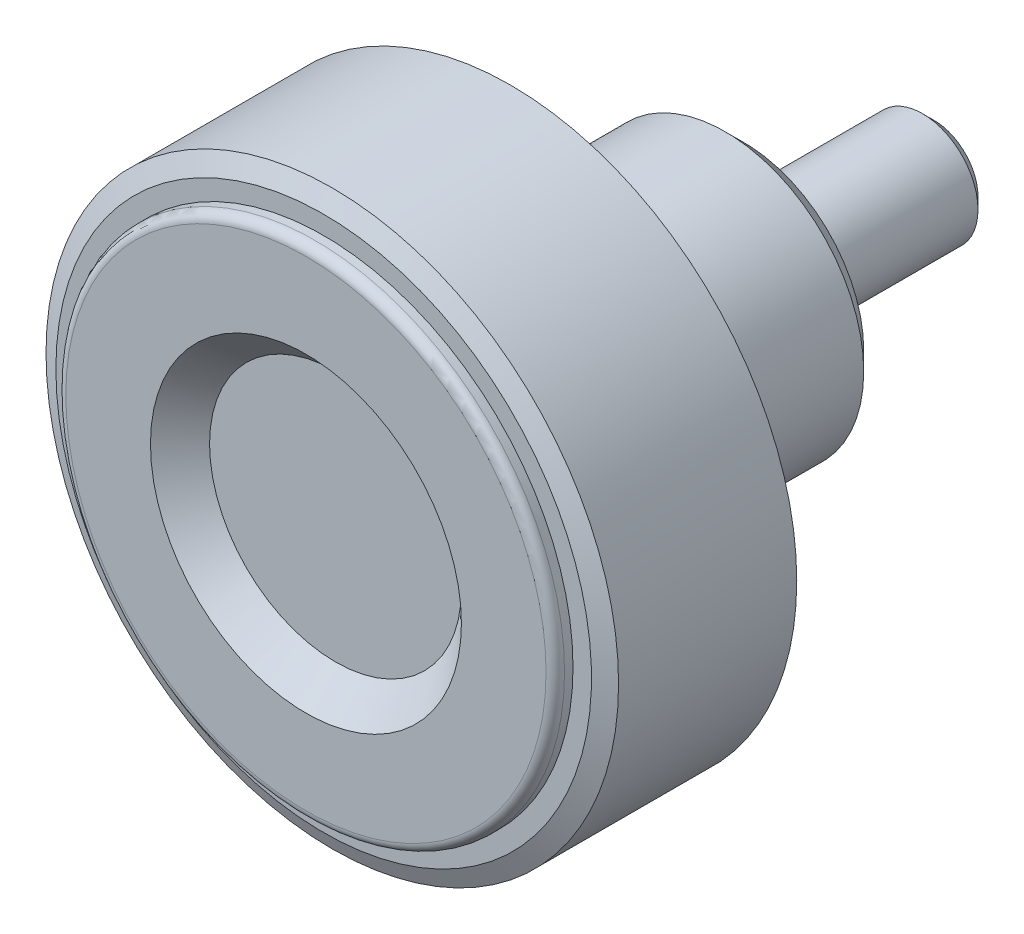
ISO-10303-21;
HEADER;
FILE_DESCRIPTION(('STEP AP214'),'2;1');
FILE_NAME('part.step','',(''),(''),'','','');
FILE_SCHEMA(('AUTOMOTIVE_DESIGN { 1 0 10303 214 1 1 1 1 }'));
ENDSEC;
DATA;
#1=APPLICATION_CONTEXT('core data for automotive mechanical design processes');
#2=APPLICATION_PROTOCOL_DEFINITION('international standard','automotive_design',2000,#1);
#3=PRODUCT_CONTEXT('',#1,'mechanical');
#4=PRODUCT('Part','Part','',(#3));
#5=PRODUCT_RELATED_PRODUCT_CATEGORY('part','',(#4));
#6=PRODUCT_DEFINITION_FORMATION('','',#4);
#7=PRODUCT_DEFINITION_CONTEXT('part definition',#1,'design');
#8=PRODUCT_DEFINITION('design','',#6,#7);
#9=PRODUCT_DEFINITION_SHAPE('','',#8);
#10=(LENGTH_UNIT() NAMED_UNIT(*) SI_UNIT(.MILLI.,.METRE.));
#11=(NAMED_UNIT(*) PLANE_ANGLE_UNIT() SI_UNIT($,.RADIAN.));
#12=(NAMED_UNIT(*) SI_UNIT($,.STERADIAN.) SOLID_ANGLE_UNIT());
#13=UNCERTAINTY_MEASURE_WITH_UNIT(LENGTH_MEASURE(1.E-05),#10,'distance_accuracy_value','');
#14=(GEOMETRIC_REPRESENTATION_CONTEXT(3) GLOBAL_UNCERTAINTY_ASSIGNED_CONTEXT((#13)) GLOBAL_UNIT_ASSIGNED_CONTEXT((#10,
#11,#12)) REPRESENTATION_CONTEXT('',''));
#15=CARTESIAN_POINT('',(0.,0.,0.));
#16=DIRECTION('',(0.,0.,1.));
#17=DIRECTION('',(1.,0.,0.));
#18=AXIS2_PLACEMENT_3D('',#15,#16,#17);
#19=CARTESIAN_POINT('',(0.,0.,0.));
#20=DIRECTION('',(0.,0.,-1.));
#21=DIRECTION('',(-1.,0.,0.));
#22=AXIS2_PLACEMENT_3D('',#19,#20,#21);
#23=CYLINDRICAL_SURFACE('',#22,15.5);
#24=CARTESIAN_POINT('',(0.,0.,22.573692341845));
#25=DIRECTION('',(0.,0.,-1.));
#26=DIRECTION('',(-1.,0.,0.));
#27=AXIS2_PLACEMENT_3D('',#24,#25,#26);
#28=CIRCLE('',#27,15.5);
#29=CARTESIAN_POINT('',(-15.5,0.,22.573692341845));
#30=VERTEX_POINT('',#29);
#31=EDGE_CURVE('E164',#30,#30,#28,.T.);
#32=ORIENTED_EDGE('',*,*,#31,.T.);
#33=EDGE_LOOP('',(#32));
#34=FACE_BOUND('',#33,.T.);
#35=CARTESIAN_POINT('',(0.,0.,12.926307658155));
#36=DIRECTION('',(0.,0.,1.));
#37=DIRECTION('',(0.,1.,0.));
#38=AXIS2_PLACEMENT_3D('',#35,#36,#37);
#39=CIRCLE('',#38,15.5);
#40=CARTESIAN_POINT('',(0.,15.5,12.926307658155));
#41=VERTEX_POINT('',#40);
#42=EDGE_CURVE('E160',#41,#41,#39,.F.);
#43=ORIENTED_EDGE('',*,*,#42,.F.);
#44=EDGE_LOOP('',(#43));
#45=FACE_BOUND('',#44,.T.);
#46=ADVANCED_FACE('F14',(#34,#45),#23,.T.);
#47=CARTESIAN_POINT('',(0.,0.,12.926307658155));
#48=DIRECTION('',(0.,0.,1.));
#49=DIRECTION('',(1.,0.,0.));
#50=AXIS2_PLACEMENT_3D('',#47,#48,#49);
#51=CONICAL_SURFACE('',#50,15.5,1.13446401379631);
#52=ORIENTED_EDGE('',*,*,#42,.T.);
#53=EDGE_LOOP('',(#52));
#54=FACE_BOUND('',#53,.T.);
#55=CARTESIAN_POINT('',(0.,0.,12.46));
#56=DIRECTION('',(0.,0.,1.));
#57=DIRECTION('',(1.,0.,0.));
#58=AXIS2_PLACEMENT_3D('',#55,#56,#57);
#59=CIRCLE('',#58,14.5);
#60=CARTESIAN_POINT('',(14.5,0.,12.46));
#61=VERTEX_POINT('',#60);
#62=EDGE_CURVE('E157',#61,#61,#59,.F.);
#63=ORIENTED_EDGE('',*,*,#62,.F.);
#64=EDGE_LOOP('',(#63));
#65=FACE_BOUND('',#64,.T.);
#66=ADVANCED_FACE('F457',(#54,#65),#51,.T.);
#67=CARTESIAN_POINT('',(0.,14.,12.46));
#68=DIRECTION('',(0.,0.,-1.));
#69=DIRECTION('',(-1.,0.,0.));
#70=AXIS2_PLACEMENT_3D('',#67,#68,#69);
#71=PLANE('',#70);
#72=ORIENTED_EDGE('',*,*,#62,.T.);
#73=EDGE_LOOP('',(#72));
#74=FACE_BOUND('',#73,.T.);
#75=CARTESIAN_POINT('',(0.,0.,12.46));
#76=DIRECTION('',(0.,0.,1.));
#77=DIRECTION('',(1.,0.,0.));
#78=AXIS2_PLACEMENT_3D('',#75,#76,#77);
#79=CIRCLE('',#78,13.5);
#80=CARTESIAN_POINT('',(13.5,0.,12.46));
#81=VERTEX_POINT('',#80);
#82=EDGE_CURVE('E154',#81,#81,#79,.F.);
#83=ORIENTED_EDGE('',*,*,#82,.F.);
#84=EDGE_LOOP('',(#83));
#85=FACE_BOUND('',#84,.T.);
#86=ADVANCED_FACE('F453',(#74,#85),#71,.T.);
#87=CARTESIAN_POINT('',(0.,1.19325,-10.));
#88=DIRECTION('',(0.,0.,-1.));
#89=DIRECTION('',(-1.,0.,0.));
#90=AXIS2_PLACEMENT_3D('',#87,#88,#89);
#91=PLANE('',#90);
#92=CARTESIAN_POINT('',(0.,0.,-9.99999999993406));
#93=DIRECTION('',(0.,0.,1.));
#94=DIRECTION('',(1.,0.,0.));
#95=AXIS2_PLACEMENT_3D('',#92,#93,#94);
#96=CIRCLE('',#95,2.38650000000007);
#97=CARTESIAN_POINT('',(2.38650000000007,0.,-9.99999999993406));
#98=VERTEX_POINT('',#97);
#99=EDGE_CURVE('E150',#98,#98,#96,.T.);
#100=ORIENTED_EDGE('',*,*,#99,.F.);
#101=EDGE_LOOP('',(#100));
#102=FACE_BOUND('',#101,.T.);
#103=ADVANCED_FACE('F449',(#102),#91,.T.);
#104=CARTESIAN_POINT('',(0.,0.,12.23));
#105=DIRECTION('',(0.,0.,1.));
#106=DIRECTION('',(1.,0.,0.));
#107=AXIS2_PLACEMENT_3D('',#104,#105,#106);
#108=CYLINDRICAL_SURFACE('',#107,13.5);
#109=ORIENTED_EDGE('',*,*,#82,.T.);
#110=EDGE_LOOP('',(#109));
#111=FACE_BOUND('',#110,.T.);
#112=CARTESIAN_POINT('',(0.,0.,12.));
#113=DIRECTION('',(0.,0.,-1.));
#114=DIRECTION('',(-1.,0.,0.));
#115=AXIS2_PLACEMENT_3D('',#112,#113,#114);
#116=CIRCLE('',#115,13.5);
#117=CARTESIAN_POINT('',(-13.5,0.,12.));
#118=VERTEX_POINT('',#117);
#119=EDGE_CURVE('E153',#118,#118,#116,.T.);
#120=ORIENTED_EDGE('',*,*,#119,.F.);
#121=EDGE_LOOP('',(#120));
#122=FACE_BOUND('',#121,.T.);
#123=ADVANCED_FACE('F416',(#111,#122),#108,.T.);
#124=CARTESIAN_POINT('',(0.,0.,-9.38649999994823));
#125=DIRECTION('',(0.,0.,1.));
#126=DIRECTION('',(1.,0.,0.));
#127=AXIS2_PLACEMENT_3D('',#124,#125,#126);
#128=CONICAL_SURFACE('',#127,2.99999999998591,0.785398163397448);
#129=ORIENTED_EDGE('',*,*,#99,.T.);
#130=EDGE_LOOP('',(#129));
#131=FACE_BOUND('',#130,.T.);
#132=CARTESIAN_POINT('',(0.,0.,-9.3865));
#133=DIRECTION('',(0.,0.,1.));
#134=DIRECTION('',(1.,0.,0.));
#135=AXIS2_PLACEMENT_3D('',#132,#133,#134);
#136=CIRCLE('',#135,3.);
#137=CARTESIAN_POINT('',(3.,0.,-9.3865));
#138=VERTEX_POINT('',#137);
#139=EDGE_CURVE('E343',#138,#138,#136,.T.);
#140=ORIENTED_EDGE('',*,*,#139,.F.);
#141=EDGE_LOOP('',(#140));
#142=FACE_BOUND('',#141,.T.);
#143=ADVANCED_FACE('F410',(#131,#142),#128,.T.);
#144=CARTESIAN_POINT('',(0.,0.,12.));
#145=DIRECTION('',(0.,0.,-1.));
#146=DIRECTION('',(-1.,0.,0.));
#147=AXIS2_PLACEMENT_3D('',#144,#145,#146);
#148=TOROIDAL_SURFACE('',#147,13.,0.5);
#149=ORIENTED_EDGE('',*,*,#119,.T.);
#150=EDGE_LOOP('',(#149));
#151=FACE_BOUND('',#150,.T.);
#152=CARTESIAN_POINT('',(0.,0.,11.5));
#153=DIRECTION('',(0.,0.,1.));
#154=DIRECTION('',(1.,0.,0.));
#155=AXIS2_PLACEMENT_3D('',#152,#153,#154);
#156=CIRCLE('',#155,13.);
#157=CARTESIAN_POINT('',(0.,13.,11.5));
#158=VERTEX_POINT('',#157);
#159=CARTESIAN_POINT('',(13.,0.,11.5));
#160=VERTEX_POINT('',#159);
#161=EDGE_CURVE('E306',#158,#160,#156,.F.);
#162=ORIENTED_EDGE('',*,*,#161,.F.);
#163=CARTESIAN_POINT('',(0.,0.,11.5));
#164=DIRECTION('',(0.,0.,1.));
#165=DIRECTION('',(0.,1.,0.));
#166=AXIS2_PLACEMENT_3D('',#163,#164,#165);
#167=CIRCLE('',#166,13.);
#168=CARTESIAN_POINT('',(-13.,0.,11.5));
#169=VERTEX_POINT('',#168);
#170=EDGE_CURVE('E149',#169,#158,#167,.F.);
#171=ORIENTED_EDGE('',*,*,#170,.F.);
#172=CARTESIAN_POINT('',(0.,0.,11.5));
#173=DIRECTION('',(0.,0.,1.));
#174=DIRECTION('',(-1.,0.,0.));
#175=AXIS2_PLACEMENT_3D('',#172,#173,#174);
#176=CIRCLE('',#175,13.);
#177=EDGE_CURVE('E340',#160,#169,#176,.F.);
#178=ORIENTED_EDGE('',*,*,#177,.F.);
#179=EDGE_LOOP('',(#162,#171,#178));
#180=FACE_BOUND('',#179,.T.);
#181=ADVANCED_FACE('F405',(#151,#180),#148,.T.);
#182=CARTESIAN_POINT('',(0.,0.,-4.19325));
#183=DIRECTION('',(0.,0.,1.));
#184=DIRECTION('',(1.,0.,0.));
#185=AXIS2_PLACEMENT_3D('',#182,#183,#184);
#186=CYLINDRICAL_SURFACE('',#185,3.);
#187=ORIENTED_EDGE('',*,*,#139,.T.);
#188=EDGE_LOOP('',(#187));
#189=FACE_BOUND('',#188,.T.);
#190=CARTESIAN_POINT('',(0.,0.,0.));
#191=DIRECTION('',(0.,0.,1.));
#192=DIRECTION('',(1.,0.,0.));
#193=AXIS2_PLACEMENT_3D('',#190,#191,#192);
#194=CIRCLE('',#193,3.);
#195=CARTESIAN_POINT('',(3.,0.,0.));
#196=VERTEX_POINT('',#195);
#197=EDGE_CURVE('E146',#196,#196,#194,.T.);
#198=ORIENTED_EDGE('',*,*,#197,.F.);
#199=EDGE_LOOP('',(#198));
#200=FACE_BOUND('',#199,.T.);
#201=ADVANCED_FACE('F323',(#189,#200),#186,.T.);
#202=CARTESIAN_POINT('',(0.,12.4615384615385,11.5));
#203=DIRECTION('',(0.,0.,-1.));
#204=DIRECTION('',(-1.,0.,0.));
#205=AXIS2_PLACEMENT_3D('',#202,#203,#204);
#206=PLANE('',#205);
#207=ORIENTED_EDGE('',*,*,#177,.T.);
#208=ORIENTED_EDGE('',*,*,#170,.T.);
#209=ORIENTED_EDGE('',*,*,#161,.T.);
#210=EDGE_LOOP('',(#207,#208,#209));
#211=FACE_BOUND('',#210,.T.);
#212=CARTESIAN_POINT('',(0.,0.,11.5));
#213=DIRECTION('',(0.,0.,1.));
#214=DIRECTION('',(1.,0.,0.));
#215=AXIS2_PLACEMENT_3D('',#212,#213,#214);
#216=CIRCLE('',#215,11.9230769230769);
#217=CARTESIAN_POINT('',(11.9230769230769,0.,11.5));
#218=VERTEX_POINT('',#217);
#219=EDGE_CURVE('E143',#218,#218,#216,.T.);
#220=ORIENTED_EDGE('',*,*,#219,.T.);
#221=EDGE_LOOP('',(#220));
#222=FACE_BOUND('',#221,.T.);
#223=ADVANCED_FACE('F312',(#211,#222),#206,.T.);
#224=CARTESIAN_POINT('',(0.,2.,0.));
#225=DIRECTION('',(0.,0.,-1.));
#226=DIRECTION('',(-1.,0.,0.));
#227=AXIS2_PLACEMENT_3D('',#224,#225,#226);
#228=PLANE('',#227);
#229=CARTESIAN_POINT('',(0.,0.,0.));
#230=DIRECTION('',(0.,0.,1.));
#231=DIRECTION('',(1.,0.,0.));
#232=AXIS2_PLACEMENT_3D('',#229,#230,#231);
#233=CIRCLE('',#232,4.);
#234=CARTESIAN_POINT('',(4.,0.,0.));
#235=VERTEX_POINT('',#234);
#236=EDGE_CURVE('E140',#235,#235,#233,.T.);
#237=ORIENTED_EDGE('',*,*,#236,.F.);
#238=EDGE_LOOP('',(#237));
#239=FACE_BOUND('',#238,.T.);
#240=ORIENTED_EDGE('',*,*,#197,.T.);
#241=EDGE_LOOP('',(#240));
#242=FACE_BOUND('',#241,.T.);
#243=ADVANCED_FACE('F322',(#239,#242),#228,.T.);
#244=CARTESIAN_POINT('',(0.,0.,15.25));
#245=DIRECTION('',(0.,0.,1.));
#246=DIRECTION('',(1.,0.,0.));
#247=AXIS2_PLACEMENT_3D('',#244,#245,#246);
#248=CYLINDRICAL_SURFACE('',#247,11.9230769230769);
#249=CARTESIAN_POINT('',(0.,0.,19.));
#250=DIRECTION('',(0.,0.,-1.));
#251=DIRECTION('',(-1.,0.,0.));
#252=AXIS2_PLACEMENT_3D('',#249,#250,#251);
#253=CIRCLE('',#252,11.9230769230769);
#254=CARTESIAN_POINT('',(-11.9230769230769,0.,19.));
#255=VERTEX_POINT('',#254);
#256=EDGE_CURVE('E139',#255,#255,#253,.F.);
#257=ORIENTED_EDGE('',*,*,#256,.T.);
#258=EDGE_LOOP('',(#257));
#259=FACE_BOUND('',#258,.T.);
#260=ORIENTED_EDGE('',*,*,#219,.F.);
#261=EDGE_LOOP('',(#260));
#262=FACE_BOUND('',#261,.T.);
#263=ADVANCED_FACE('F391',(#259,#262),#248,.F.);
#264=CARTESIAN_POINT('',(0.,0.,0.15));
#265=DIRECTION('',(0.,0.,1.));
#266=DIRECTION('',(1.,0.,0.));
#267=AXIS2_PLACEMENT_3D('',#264,#265,#266);
#268=CYLINDRICAL_SURFACE('',#267,4.);
#269=ORIENTED_EDGE('',*,*,#236,.T.);
#270=EDGE_LOOP('',(#269));
#271=FACE_BOUND('',#270,.T.);
#272=CARTESIAN_POINT('',(0.,0.,0.3));
#273=DIRECTION('',(0.,0.,1.));
#274=DIRECTION('',(1.,0.,0.));
#275=AXIS2_PLACEMENT_3D('',#272,#273,#274);
#276=CIRCLE('',#275,4.);
#277=CARTESIAN_POINT('',(4.,0.,0.3));
#278=VERTEX_POINT('',#277);
#279=EDGE_CURVE('E135',#278,#278,#276,.T.);
#280=ORIENTED_EDGE('',*,*,#279,.F.);
#281=EDGE_LOOP('',(#280));
#282=FACE_BOUND('',#281,.T.);
#283=ADVANCED_FACE('F282',(#271,#282),#268,.T.);
#284=CARTESIAN_POINT('',(0.,0.,19.));
#285=DIRECTION('',(0.,0.,-1.));
#286=DIRECTION('',(-1.,0.,0.));
#287=AXIS2_PLACEMENT_3D('',#284,#285,#286);
#288=TOROIDAL_SURFACE('',#287,10.9230769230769,1.);
#289=CARTESIAN_POINT('',(0.,0.,20.));
#290=DIRECTION('',(0.,0.,1.));
#291=DIRECTION('',(0.,1.,0.));
#292=AXIS2_PLACEMENT_3D('',#289,#290,#291);
#293=CIRCLE('',#292,10.9230769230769);
#294=CARTESIAN_POINT('',(-10.9230769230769,0.,20.));
#295=VERTEX_POINT('',#294);
#296=CARTESIAN_POINT('',(0.,10.9230769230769,20.));
#297=VERTEX_POINT('',#296);
#298=EDGE_CURVE('E134',#295,#297,#293,.F.);
#299=ORIENTED_EDGE('',*,*,#298,.F.);
#300=CARTESIAN_POINT('',(0.,0.,20.));
#301=DIRECTION('',(0.,0.,1.));
#302=DIRECTION('',(-1.,0.,0.));
#303=AXIS2_PLACEMENT_3D('',#300,#301,#302);
#304=CIRCLE('',#303,10.9230769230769);
#305=CARTESIAN_POINT('',(10.9230769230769,0.,20.));
#306=VERTEX_POINT('',#305);
#307=EDGE_CURVE('E656',#306,#295,#304,.F.);
#308=ORIENTED_EDGE('',*,*,#307,.F.);
#309=CARTESIAN_POINT('',(0.,0.,20.));
#310=DIRECTION('',(0.,0.,1.));
#311=DIRECTION('',(1.,0.,0.));
#312=AXIS2_PLACEMENT_3D('',#309,#310,#311);
#313=CIRCLE('',#312,10.9230769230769);
#314=EDGE_CURVE('E138',#297,#306,#313,.F.);
#315=ORIENTED_EDGE('',*,*,#314,.F.);
#316=EDGE_LOOP('',(#299,#308,#315));
#317=FACE_BOUND('',#316,.T.);
#318=ORIENTED_EDGE('',*,*,#256,.F.);
#319=EDGE_LOOP('',(#318));
#320=FACE_BOUND('',#319,.T.);
#321=ADVANCED_FACE('F278',(#317,#320),#288,.F.);
#322=CARTESIAN_POINT('',(0.,5.25,0.3));
#323=DIRECTION('',(0.,0.,-1.));
#324=DIRECTION('',(-1.,0.,0.));
#325=AXIS2_PLACEMENT_3D('',#322,#323,#324);
#326=PLANE('',#325);
#327=CARTESIAN_POINT('',(0.,0.,0.3));
#328=DIRECTION('',(0.,0.,1.));
#329=DIRECTION('',(1.,0.,0.));
#330=AXIS2_PLACEMENT_3D('',#327,#328,#329);
#331=CIRCLE('',#330,6.5);
#332=CARTESIAN_POINT('',(6.5,0.,0.3));
#333=VERTEX_POINT('',#332);
#334=EDGE_CURVE('E125',#333,#333,#331,.T.);
#335=ORIENTED_EDGE('',*,*,#334,.F.);
#336=EDGE_LOOP('',(#335));
#337=FACE_BOUND('',#336,.T.);
#338=ORIENTED_EDGE('',*,*,#279,.T.);
#339=EDGE_LOOP('',(#338));
#340=FACE_BOUND('',#339,.T.);
#341=ADVANCED_FACE('F216',(#337,#340),#326,.T.);
#342=CARTESIAN_POINT('',(0.,9.71153846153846,20.));
#343=DIRECTION('',(0.,0.,-1.));
#344=DIRECTION('',(-1.,0.,0.));
#345=AXIS2_PLACEMENT_3D('',#342,#343,#344);
#346=PLANE('',#345);
#347=ORIENTED_EDGE('',*,*,#307,.T.);
#348=ORIENTED_EDGE('',*,*,#298,.T.);
#349=ORIENTED_EDGE('',*,*,#314,.T.);
#350=EDGE_LOOP('',(#347,#348,#349));
#351=FACE_BOUND('',#350,.T.);
#352=CARTESIAN_POINT('',(0.,0.,20.));
#353=DIRECTION('',(0.,0.,-1.));
#354=DIRECTION('',(-1.,0.,0.));
#355=AXIS2_PLACEMENT_3D('',#352,#353,#354);
#356=CIRCLE('',#355,8.5);
#357=CARTESIAN_POINT('',(0.,8.5,20.));
#358=VERTEX_POINT('',#357);
#359=CARTESIAN_POINT('',(-8.5,0.,20.));
#360=VERTEX_POINT('',#359);
#361=EDGE_CURVE('E33',#358,#360,#356,.F.);
#362=ORIENTED_EDGE('',*,*,#361,.T.);
#363=CARTESIAN_POINT('',(0.,0.,20.));
#364=DIRECTION('',(0.,0.,-1.));
#365=DIRECTION('',(1.,0.,0.));
#366=AXIS2_PLACEMENT_3D('',#363,#364,#365);
#367=CIRCLE('',#366,8.5);
#368=CARTESIAN_POINT('',(8.5,0.,20.));
#369=VERTEX_POINT('',#368);
#370=EDGE_CURVE('E133',#360,#369,#367,.F.);
#371=ORIENTED_EDGE('',*,*,#370,.T.);
#372=CARTESIAN_POINT('',(0.,0.,20.));
#373=DIRECTION('',(0.,0.,-1.));
#374=DIRECTION('',(0.,1.,0.));
#375=AXIS2_PLACEMENT_3D('',#372,#373,#374);
#376=CIRCLE('',#375,8.5);
#377=EDGE_CURVE('E203',#369,#358,#376,.F.);
#378=ORIENTED_EDGE('',*,*,#377,.T.);
#379=EDGE_LOOP('',(#362,#371,#378));
#380=FACE_BOUND('',#379,.T.);
#381=ADVANCED_FACE('F207',(#351,#380),#346,.T.);
#382=CARTESIAN_POINT('',(0.,0.,1.3));
#383=DIRECTION('',(0.,0.,1.));
#384=DIRECTION('',(1.,0.,0.));
#385=AXIS2_PLACEMENT_3D('',#382,#383,#384);
#386=CONICAL_SURFACE('',#385,7.5,0.785398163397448);
#387=ORIENTED_EDGE('',*,*,#334,.T.);
#388=EDGE_LOOP('',(#387));
#389=FACE_BOUND('',#388,.T.);
#390=CARTESIAN_POINT('',(0.,0.,1.3));
#391=DIRECTION('',(0.,0.,1.));
#392=DIRECTION('',(1.,0.,0.));
#393=AXIS2_PLACEMENT_3D('',#390,#391,#392);
#394=CIRCLE('',#393,7.5);
#395=CARTESIAN_POINT('',(7.5,0.,1.3));
#396=VERTEX_POINT('',#395);
#397=EDGE_CURVE('E24',#396,#396,#394,.T.);
#398=ORIENTED_EDGE('',*,*,#397,.F.);
#399=EDGE_LOOP('',(#398));
#400=FACE_BOUND('',#399,.T.);
#401=ADVANCED_FACE('F194',(#389,#400),#386,.T.);
#402=CARTESIAN_POINT('',(0.,0.,19.));
#403=DIRECTION('',(0.,0.,-1.));
#404=DIRECTION('',(-1.,0.,0.));
#405=AXIS2_PLACEMENT_3D('',#402,#403,#404);
#406=TOROIDAL_SURFACE('',#405,8.5,1.);
#407=CARTESIAN_POINT('',(0.,0.,19.));
#408=DIRECTION('',(0.,0.,1.));
#409=DIRECTION('',(1.,0.,0.));
#410=AXIS2_PLACEMENT_3D('',#407,#408,#409);
#411=CIRCLE('',#410,7.5);
#412=CARTESIAN_POINT('',(7.5,0.,19.));
#413=VERTEX_POINT('',#412);
#414=EDGE_CURVE('E9',#413,#413,#411,.F.);
#415=ORIENTED_EDGE('',*,*,#414,.F.);
#416=EDGE_LOOP('',(#415));
#417=FACE_BOUND('',#416,.T.);
#418=ORIENTED_EDGE('',*,*,#370,.F.);
#419=ORIENTED_EDGE('',*,*,#361,.F.);
#420=ORIENTED_EDGE('',*,*,#377,.F.);
#421=EDGE_LOOP('',(#418,#419,#420));
#422=FACE_BOUND('',#421,.T.);
#423=ADVANCED_FACE('F182',(#417,#422),#406,.F.);
#424=CARTESIAN_POINT('',(0.,0.,10.15));
#425=DIRECTION('',(0.,0.,1.));
#426=DIRECTION('',(1.,0.,0.));
#427=AXIS2_PLACEMENT_3D('',#424,#425,#426);
#428=CYLINDRICAL_SURFACE('',#427,7.5);
#429=ORIENTED_EDGE('',*,*,#397,.T.);
#430=EDGE_LOOP('',(#429));
#431=FACE_BOUND('',#430,.T.);
#432=ORIENTED_EDGE('',*,*,#414,.T.);
#433=EDGE_LOOP('',(#432));
#434=FACE_BOUND('',#433,.T.);
#435=ADVANCED_FACE('F193',(#431,#434),#428,.T.);
#436=CARTESIAN_POINT('',(0.,3.40909090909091,22.4));
#437=DIRECTION('',(0.,0.,1.));
#438=DIRECTION('',(1.,0.,0.));
#439=AXIS2_PLACEMENT_3D('',#436,#437,#438);
#440=PLANE('',#439);
#441=CARTESIAN_POINT('',(0.,0.,22.4));
#442=DIRECTION('',(0.,0.,1.));
#443=DIRECTION('',(1.,0.,0.));
#444=AXIS2_PLACEMENT_3D('',#441,#442,#443);
#445=CIRCLE('',#444,6.81818181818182);
#446=CARTESIAN_POINT('',(6.81818181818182,0.,22.4));
#447=VERTEX_POINT('',#446);
#448=EDGE_CURVE('E171',#447,#447,#445,.T.);
#449=ORIENTED_EDGE('',*,*,#448,.T.);
#450=EDGE_LOOP('',(#449));
#451=FACE_BOUND('',#450,.T.);
#452=ADVANCED_FACE('F16',(#451),#440,.T.);
#453=CARTESIAN_POINT('',(0.,0.,24.));
#454=DIRECTION('',(0.,0.,1.));
#455=DIRECTION('',(1.,0.,0.));
#456=AXIS2_PLACEMENT_3D('',#453,#454,#455);
#457=CONICAL_SURFACE('',#456,8.41818181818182,0.785398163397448);
#458=CARTESIAN_POINT('',(0.,0.,24.));
#459=DIRECTION('',(0.,0.,1.));
#460=DIRECTION('',(1.,0.,0.));
#461=AXIS2_PLACEMENT_3D('',#458,#459,#460);
#462=CIRCLE('',#461,8.41818181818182);
#463=CARTESIAN_POINT('',(8.41818181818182,0.,24.));
#464=VERTEX_POINT('',#463);
#465=EDGE_CURVE('E77',#464,#464,#462,.F.);
#466=ORIENTED_EDGE('',*,*,#465,.F.);
#467=EDGE_LOOP('',(#466));
#468=FACE_BOUND('',#467,.T.);
#469=ORIENTED_EDGE('',*,*,#448,.F.);
#470=EDGE_LOOP('',(#469));
#471=FACE_BOUND('',#470,.T.);
#472=ADVANCED_FACE('F99',(#468,#471),#457,.F.);
#473=CARTESIAN_POINT('',(0.,10.7090909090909,24.));
#474=DIRECTION('',(0.,0.,1.));
#475=DIRECTION('',(1.,0.,0.));
#476=AXIS2_PLACEMENT_3D('',#473,#474,#475);
#477=PLANE('',#476);
#478=ORIENTED_EDGE('',*,*,#465,.T.);
#479=EDGE_LOOP('',(#478));
#480=FACE_BOUND('',#479,.T.);
#481=CARTESIAN_POINT('',(0.,0.,24.));
#482=DIRECTION('',(0.,0.,-1.));
#483=DIRECTION('',(-1.,0.,0.));
#484=AXIS2_PLACEMENT_3D('',#481,#482,#483);
#485=CIRCLE('',#484,13.);
#486=CARTESIAN_POINT('',(-13.,0.,24.));
#487=VERTEX_POINT('',#486);
#488=CARTESIAN_POINT('',(0.,13.,24.));
#489=VERTEX_POINT('',#488);
#490=EDGE_CURVE('E71',#487,#489,#485,.T.);
#491=ORIENTED_EDGE('',*,*,#490,.F.);
#492=CARTESIAN_POINT('',(0.,0.,24.));
#493=DIRECTION('',(0.,0.,-1.));
#494=DIRECTION('',(1.,0.,0.));
#495=AXIS2_PLACEMENT_3D('',#492,#493,#494);
#496=CIRCLE('',#495,13.);
#497=CARTESIAN_POINT('',(13.,0.,24.));
#498=VERTEX_POINT('',#497);
#499=EDGE_CURVE('E66',#498,#487,#496,.T.);
#500=ORIENTED_EDGE('',*,*,#499,.F.);
#501=CARTESIAN_POINT('',(0.,0.,24.));
#502=DIRECTION('',(0.,0.,-1.));
#503=DIRECTION('',(0.,1.,0.));
#504=AXIS2_PLACEMENT_3D('',#501,#502,#503);
#505=CIRCLE('',#504,13.);
#506=EDGE_CURVE('E73',#489,#498,#505,.T.);
#507=ORIENTED_EDGE('',*,*,#506,.F.);
#508=EDGE_LOOP('',(#491,#500,#507));
#509=FACE_BOUND('',#508,.T.);
#510=ADVANCED_FACE('F81',(#480,#509),#477,.T.);
#511=CARTESIAN_POINT('',(0.,0.,23.5));
#512=DIRECTION('',(0.,0.,-1.));
#513=DIRECTION('',(-1.,0.,0.));
#514=AXIS2_PLACEMENT_3D('',#511,#512,#513);
#515=TOROIDAL_SURFACE('',#514,13.,0.5);
#516=ORIENTED_EDGE('',*,*,#499,.T.);
#517=ORIENTED_EDGE('',*,*,#490,.T.);
#518=ORIENTED_EDGE('',*,*,#506,.T.);
#519=EDGE_LOOP('',(#516,#517,#518));
#520=FACE_BOUND('',#519,.T.);
#521=CARTESIAN_POINT('',(0.,0.,23.5));
#522=DIRECTION('',(0.,0.,1.));
#523=DIRECTION('',(1.,0.,0.));
#524=AXIS2_PLACEMENT_3D('',#521,#522,#523);
#525=CIRCLE('',#524,13.5);
#526=CARTESIAN_POINT('',(13.5,0.,23.5));
#527=VERTEX_POINT('',#526);
#528=EDGE_CURVE('E168',#527,#527,#525,.F.);
#529=ORIENTED_EDGE('',*,*,#528,.F.);
#530=EDGE_LOOP('',(#529));
#531=FACE_BOUND('',#530,.T.);
#532=ADVANCED_FACE('F69',(#520,#531),#515,.T.);
#533=CARTESIAN_POINT('',(0.,0.,23.27));
#534=DIRECTION('',(0.,0.,1.));
#535=DIRECTION('',(1.,0.,0.));
#536=AXIS2_PLACEMENT_3D('',#533,#534,#535);
#537=CYLINDRICAL_SURFACE('',#536,13.5);
#538=CARTESIAN_POINT('',(0.,0.,23.04));
#539=DIRECTION('',(0.,0.,1.));
#540=DIRECTION('',(1.,0.,0.));
#541=AXIS2_PLACEMENT_3D('',#538,#539,#540);
#542=CIRCLE('',#541,13.5);
#543=CARTESIAN_POINT('',(13.5,0.,23.04));
#544=VERTEX_POINT('',#543);
#545=EDGE_CURVE('E165',#544,#544,#542,.F.);
#546=ORIENTED_EDGE('',*,*,#545,.F.);
#547=EDGE_LOOP('',(#546));
#548=FACE_BOUND('',#547,.T.);
#549=ORIENTED_EDGE('',*,*,#528,.T.);
#550=EDGE_LOOP('',(#549));
#551=FACE_BOUND('',#550,.T.);
#552=ADVANCED_FACE('F359',(#548,#551),#537,.T.);
#553=CARTESIAN_POINT('',(0.,0.,22.573692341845));
#554=DIRECTION('',(0.,0.,-1.));
#555=DIRECTION('',(-1.,0.,0.));
#556=AXIS2_PLACEMENT_3D('',#553,#554,#555);
#557=CONICAL_SURFACE('',#556,15.5,1.13446401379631);
#558=ORIENTED_EDGE('',*,*,#31,.F.);
#559=EDGE_LOOP('',(#558));
#560=FACE_BOUND('',#559,.T.);
#561=CARTESIAN_POINT('',(0.,0.,23.04));
#562=DIRECTION('',(0.,0.,-1.));
#563=DIRECTION('',(-1.,0.,0.));
#564=AXIS2_PLACEMENT_3D('',#561,#562,#563);
#565=CIRCLE('',#564,14.5);
#566=CARTESIAN_POINT('',(-14.5,0.,23.04));
#567=VERTEX_POINT('',#566);
#568=EDGE_CURVE('E161',#567,#567,#565,.T.);
#569=ORIENTED_EDGE('',*,*,#568,.T.);
#570=EDGE_LOOP('',(#569));
#571=FACE_BOUND('',#570,.T.);
#572=ADVANCED_FACE('F366',(#560,#571),#557,.T.);
#573=CARTESIAN_POINT('',(0.,14.,23.04));
#574=DIRECTION('',(0.,0.,1.));
#575=DIRECTION('',(1.,0.,0.));
#576=AXIS2_PLACEMENT_3D('',#573,#574,#575);
#577=PLANE('',#576);
#578=ORIENTED_EDGE('',*,*,#545,.T.);
#579=EDGE_LOOP('',(#578));
#580=FACE_BOUND('',#579,.T.);
#581=ORIENTED_EDGE('',*,*,#568,.F.);
#582=EDGE_LOOP('',(#581));
#583=FACE_BOUND('',#582,.T.);
#584=ADVANCED_FACE('F467',(#580,#583),#577,.T.);
#585=CLOSED_SHELL('',(#46,#66,#86,#103,#123,#143,#181,#201,#223,#243,#263,#283,#321,#341,#381,
#401,#423,#435,#452,#472,#510,#532,#552,#572,#584));
#586=MANIFOLD_SOLID_BREP('B1',#585);
#587=ADVANCED_BREP_SHAPE_REPRESENTATION('',(#18,#586),#14);
#588=SHAPE_DEFINITION_REPRESENTATION(#9,#587);
ENDSEC;
END-ISO-10303-21;
